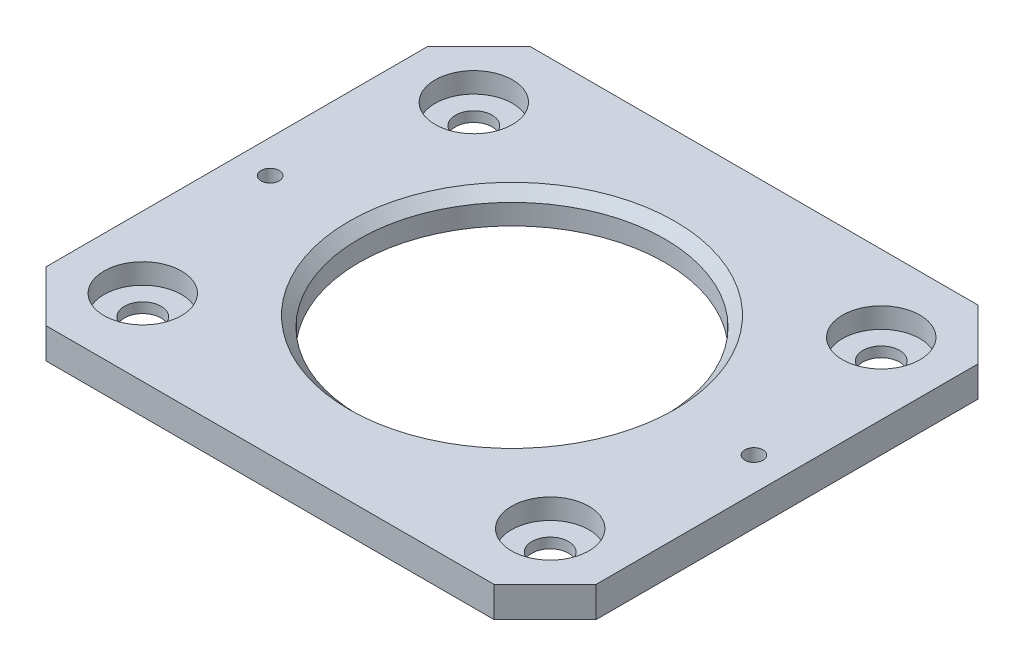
from build123d import *

# Parameters (mm, degrees)
SKETCH1_W                     = 68.58
SKETCH1_H                     = 60.325
BOSS_EXTRUDE1_DEPTH           = 3.81
CHAMFER1_SIZE                 = 6.35
CUT_EXTRUDE2_DEPTH            = 46.826810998
CUT_EXTRUDE2_DEPTH_BACK       = 46.826810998
SKETCH3_R                     = 19.05
CUT_EXTRUDE3_DEPTH            = 46.826810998
CUT_EXTRUDE3_DEPTH_BACK       = 46.826810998
SKETCH4_R                     = 2.286
CUT_EXTRUDE4_START            = -1.27
SKETCH5_R                     = 4.826
CUT_EXTRUDE4_DEPTH            = 2.54
TAP_DRILL_FOR_4_40_TAP1_D     = 2.2606
TAP_DRILL_FOR_4_40_TAP1_DEPTH = 1.860847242
TAP_DRILL_FOR_4_40_TAP1_TIP   = 0.679152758
CHAMFER2_SIZE                 = 1.27
SKETCH11_R                    = 23.8633
SKETCH11_R_2                  = 22.0853
CUT_EXTRUDE5_DEPTH            = 1.190625


with BuildPart() as part:
    # Sketch1 → Boss-Extrude1 (new body)
    with BuildSketch(Plane(origin=(0, 0, 0), x_dir=(1, 0, 0), z_dir=(0, 1, 0))):
        Rectangle(SKETCH1_W, SKETCH1_H)
    extrude(amount=BOSS_EXTRUDE1_DEPTH)

    # Chamfer1
    chamfer1_edges = [part.edges().sort_by_distance(p)[0] for p in [
        (34.29, 1.905, 30.1625),
        (-34.29, 1.905, 30.1625),
        (-34.29, 1.905, -30.1625),
        (34.29, 1.905, -30.1625),
    ]]
    chamfer(chamfer1_edges, length=CHAMFER1_SIZE)

    # Sketch3 → Cut-Extrude2 (cut, two sides: drawn at the far end of the back side and taken through both)
    with BuildSketch(Plane(origin=(0, 3.81, 0), x_dir=(1, 0, 0), z_dir=(0, 1, 0)).offset(-CUT_EXTRUDE2_DEPTH_BACK)):
        with Locations(Location((0, 0, 0), (0, 0, 270))):
            Circle(SKETCH3_R)
    extrude(amount=CUT_EXTRUDE2_DEPTH + CUT_EXTRUDE2_DEPTH_BACK, mode=Mode.SUBTRACT)

    # Sketch4 → Cut-Extrude3 (cut, two sides: drawn at the far end of the back side and taken through both)
    with BuildSketch(Plane.XZ.offset(-CUT_EXTRUDE3_DEPTH_BACK)):
        with Locations(Location((-25.4, 20.6375, 0), (0, 0, 270))):
            Circle(SKETCH4_R)
        with Locations(Location((-25.4, -20.6375, 0), (0, 0, 270))):
            Circle(SKETCH4_R)
        with Locations(Location((25.4, -20.6375, 0), (0, 0, 270))):
            Circle(SKETCH4_R)
        with Locations(Location((25.4, 20.6375, 0), (0, 0, 270))):
            Circle(SKETCH4_R)
    extrude(amount=CUT_EXTRUDE3_DEPTH + CUT_EXTRUDE3_DEPTH_BACK, mode=Mode.SUBTRACT)

    # Sketch5 → Cut-Extrude4 (cut)
    with BuildSketch(Plane.XZ.offset(CUT_EXTRUDE4_START)):
        with Locations(Location((-25.4, 20.6375, 0), (0, 0, 270))):
            Circle(SKETCH5_R)
        with Locations(Location((-25.4, -20.6375, 0), (0, 0, 270))):
            Circle(SKETCH5_R)
        with Locations(Location((25.4, -20.6375, 0), (0, 0, 270))):
            Circle(SKETCH5_R)
        with Locations(Location((25.4, 20.6375, 0), (0, 0, 270))):
            Circle(SKETCH5_R)
    extrude(amount=-CUT_EXTRUDE4_DEPTH, mode=Mode.SUBTRACT)

    # Tap Drill for _4-40 Tap1
    with Locations(Plane(origin=(-30.1625, 3.81, 0), x_dir=(0, 0, 1), z_dir=(0, 1, 0))):
        with Locations((0, 0), (0, 60.325)):
            Hole(TAP_DRILL_FOR_4_40_TAP1_D / 2, depth=TAP_DRILL_FOR_4_40_TAP1_DEPTH)
            with Locations((0, 0, -(TAP_DRILL_FOR_4_40_TAP1_DEPTH + TAP_DRILL_FOR_4_40_TAP1_TIP / 2))):  # 118° drill point
                Cone(0, TAP_DRILL_FOR_4_40_TAP1_D / 2, TAP_DRILL_FOR_4_40_TAP1_TIP, mode=Mode.SUBTRACT)

    # Chamfer2
    chamfer2_edges = [part.edges().sort_by_distance(p)[0] for p in [
        (0, 3.81, -19.05),
    ]]
    chamfer(chamfer2_edges, length=CHAMFER2_SIZE)

    # Sketch11 → Cut-Extrude5 (cut)
    with BuildSketch(Plane.XZ):
        with Locations(Location((0, 0, 0), (0, 0, 270))):
            Circle(SKETCH11_R)
        with Locations(Location((0, 0, 0), (0, 0, 270))):
            Circle(SKETCH11_R_2, mode=Mode.SUBTRACT)
    extrude(amount=-CUT_EXTRUDE5_DEPTH, mode=Mode.SUBTRACT)


solid = part.part
